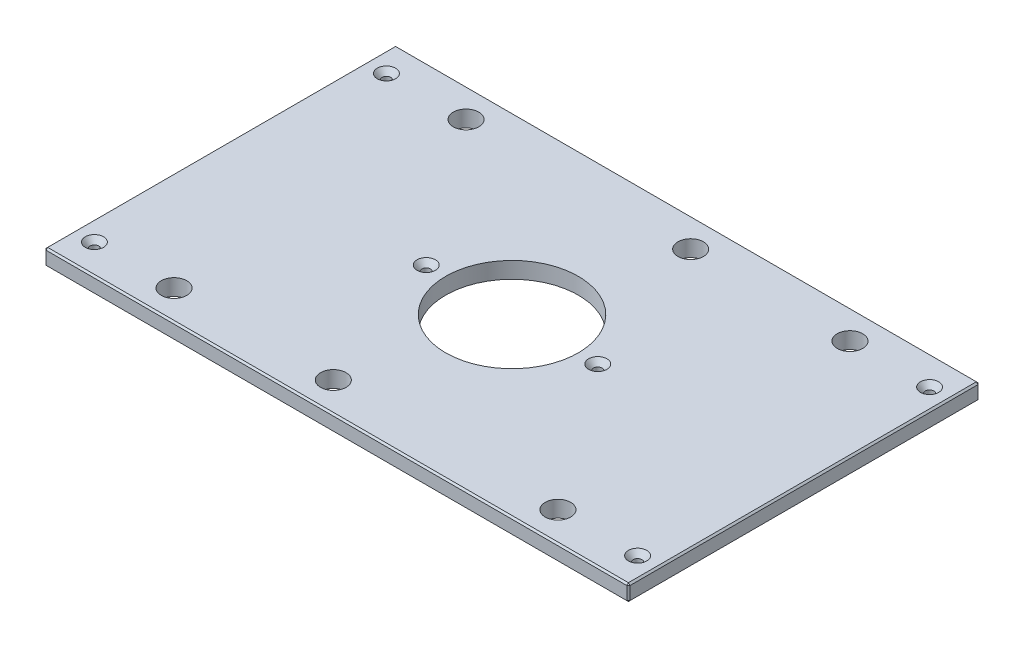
from build123d import *

# Parameters (mm, degrees)
SKETCH1_W                                        = 454.025
SKETCH1_H                                        = 273.05
BOSS_EXTRUDE1_DEPTH                              = 12.7
SKETCH13_R                                       = 51.562
CUT_EXTRUDE6_DEPTH                               = 266.207542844
F_25_32_0_78125_DIAMETER_HOLE1_D                 = 19.84375
CHAMFER2_SIZE                                    = 1.27
CSK_FOR_1_4_FLAT_HEAD_MACHINE_SCREW1_D           = 6.7564
CSK_FOR_1_4_FLAT_HEAD_MACHINE_SCREW1_CSINK_D     = 14.2748
CSK_FOR_1_4_FLAT_HEAD_MACHINE_SCREW1_CSINK_ANGLE = 82


with BuildPart() as part:
    # Sketch1 → Boss-Extrude1 (new body)
    with BuildSketch(Plane(origin=(0, 0, 0), x_dir=(1, 0, 0), z_dir=(0, 1, 0))):
        Rectangle(SKETCH1_W, SKETCH1_H)
    extrude(amount=BOSS_EXTRUDE1_DEPTH)

    # Sketch13 → Cut-Extrude6 (cut, through all)
    with BuildSketch(Plane(origin=(0, 12.7, 0), x_dir=(1, 0, 0), z_dir=(0, 1, 0))):
        with Locations(Location((0, 0, 0), (0, 0, 270))):
            Circle(SKETCH13_R)
    extrude(amount=-CUT_EXTRUDE6_DEPTH, mode=Mode.SUBTRACT)

    # 25_32 _0.78125_ Diameter Hole1 (through all)
    with Locations(Plane(origin=(0, 12.7, 0), x_dir=(1, 0, 0), z_dir=(0, 1, 0))):
        with Locations((149.225, 113.50498), (-149.225, 113.50498), (149.225, -113.50498), (-149.225, -113.50498), (25.4, 113.50498), (-25.4, -113.50498)):
            Hole(F_25_32_0_78125_DIAMETER_HOLE1_D / 2)

    # Chamfer2
    chamfer2_edges = [part.edges().sort_by_distance(p)[0] for p in [
        (227.0125, 12.7, 0),
        (0, 12.7, -136.525),
        (-227.0125, 12.7, 0),
        (0, 0, -136.525),
        (227.0125, 0, 0),
        (0, 0, 136.525),
        (-227.0125, 0, 0),
        (0, 12.7, 136.525),
        (-227.0125, 6.35, -136.525),
        (227.0125, 6.35, -136.525),
        (227.0125, 6.35, 136.525),
        (-227.0125, 6.35, 136.525),
    ]]
    chamfer(chamfer2_edges, length=CHAMFER2_SIZE)

    # CSK for 1_4 Flat Head Machine Screw1 (through all)
    with Locations(Plane(origin=(0, 12.7, 0), x_dir=(1, 0, 0), z_dir=(0, 1, 0))):
        with Locations((211.1375, 113.50498), (211.1375, -113.50498), (-211.1375, -113.50498), (-66.675, 0), (66.675, 0), (-211.1375, 113.50498), (-149.225, 113.50498), (-149.225, -113.50498)):
            CounterSinkHole(CSK_FOR_1_4_FLAT_HEAD_MACHINE_SCREW1_D / 2, CSK_FOR_1_4_FLAT_HEAD_MACHINE_SCREW1_CSINK_D / 2, counter_sink_angle=CSK_FOR_1_4_FLAT_HEAD_MACHINE_SCREW1_CSINK_ANGLE)


solid = part.part
